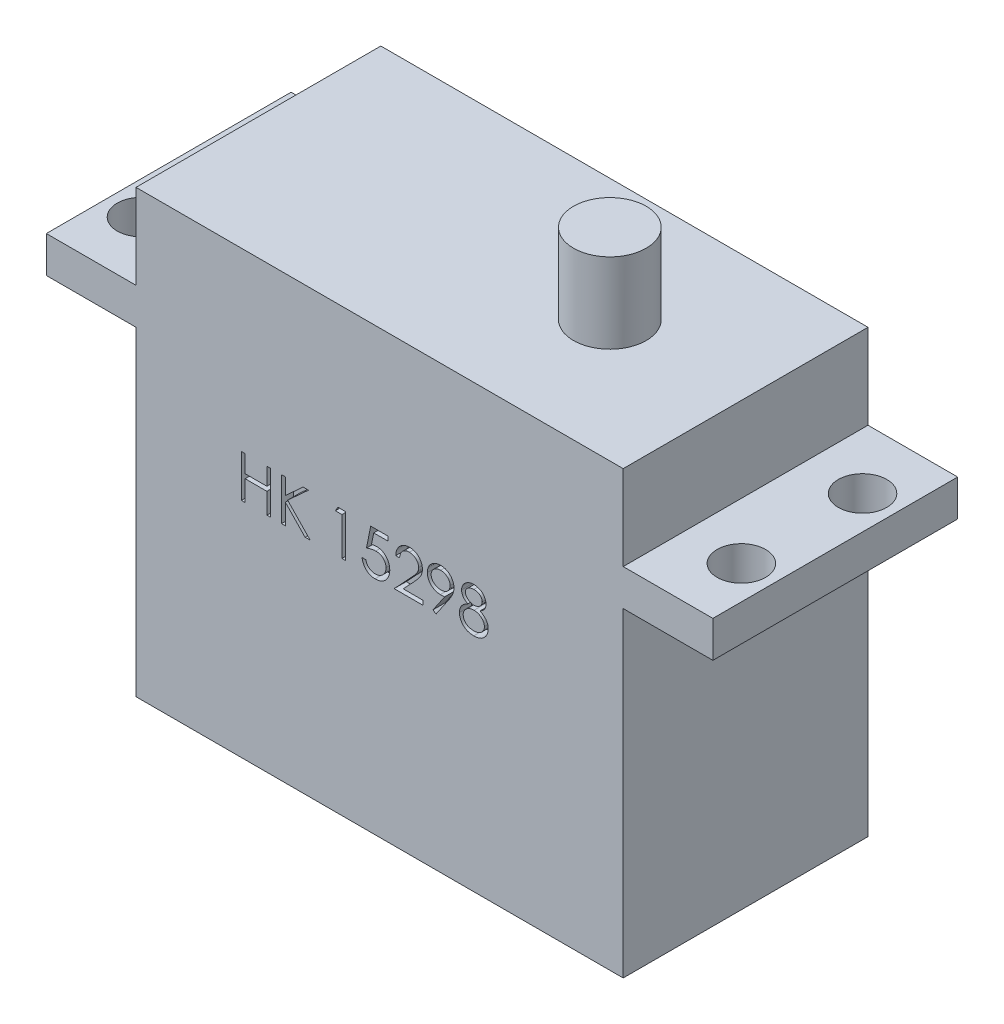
from build123d import *

# Parameters (mm, degrees)
BOSS_EXTRU_1_DEPTH      = 20.2
ESQUISSE2_R             = 2
ENL_V_MAT_EXTRU_1_DEPTH = 60.482434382
ESQUISSE3_R             = 3
BOSS_EXTRU_2_DEPTH      = 6.6
ENL_V_MAT_EXTRU_2_DEPTH = 1


with BuildPart() as part:
    # Esquisse1 → Boss.-Extru.1 (new body)
    with BuildSketch(Plane.XY):
        Polygon((0, 29.4), (0, 36.4), (40.2, 36.4), (40.2, 29.4), (47.6, 29.4), (47.6, 26.4), (40.2, 26.4), (40.2, 0), (0, 0), (0, 26.4), (-7.4, 26.4), (-7.4, 29.4), align=None)
    extrude(amount=BOSS_EXTRU_1_DEPTH)

    # Esquisse2 → Enl_v. mat.-Extru.1 (cut, through all)
    with BuildSketch(Plane(origin=(0, 29.4, 0), x_dir=(1, 0, 0), z_dir=(0, 1, 0))):
        with Locations(Location((-4.65, -5.1, 0), (0, 0, 270))):
            Circle(ESQUISSE2_R)
        with Locations(Location((-4.65, -15.1, 0), (0, 0, 270))):
            Circle(ESQUISSE2_R)
        with Locations(Location((44.85, -15.1, 0), (0, 0, 270))):
            Circle(ESQUISSE2_R)
        with Locations(Location((44.85, -5.1, 0), (0, 0, 270))):
            Circle(ESQUISSE2_R)
    extrude(amount=-ENL_V_MAT_EXTRU_1_DEPTH, mode=Mode.SUBTRACT)

    # Esquisse3 → Boss.-Extru.2 (add)
    with BuildSketch(Plane(origin=(0, 36.4, 0), x_dir=(1, 0, 0), z_dir=(0, 1, 0))):
        with Locations(Location((29, -10.1, 0), (0, 0, 90))):
            Circle(ESQUISSE3_R)
    extrude(amount=BOSS_EXTRU_2_DEPTH)

    # Esquisse4 → Enl_v. mat.-Extru.2 (cut)
    # profile 1 of 7: a face of its own
    with BuildSketch(Plane.XY.offset(20.2)):
        Polygon((8.690449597, 21.874406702), (9.004552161, 21.874406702), (9.004552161, 20.438509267), (10.799423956, 20.438509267), (10.799423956, 21.874406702), (11.11352652, 21.874406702), (11.11352652, 18.374406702), (10.799423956, 18.374406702), (10.799423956, 20.079534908), (9.004552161, 20.079534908), (9.004552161, 18.374406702), (8.690449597, 18.374406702), align=None)
    # profile 2 of 7: a face of its own
    with BuildSketch(Plane.XY.offset(20.2)):
        Polygon((12.010962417, 21.874406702), (12.325064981, 21.874406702), (12.325064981, 20.54157417), (13.784099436, 21.874406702), (14.232116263, 21.874406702), (12.5122645, 20.303893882), (14.366731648, 18.374406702), (13.948161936, 18.374406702), (12.325064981, 20.063409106), (12.325064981, 18.374406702), (12.010962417, 18.374406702), align=None)
    # profile 3 of 7: a face of its own
    with BuildSketch(Plane.XY.offset(20.2)):
        Polygon((16.658698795, 21.874406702), (17.305834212, 21.874406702), (17.305834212, 18.374406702), (16.991731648, 18.374406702), (16.991731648, 21.515432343), (16.453270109, 21.515432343), align=None)
    # profile 4 of 7: a face of its own
    with BuildSketch(Plane.XY.offset(20.2)):
        with BuildLine():
            Line((20.805834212, 21.874406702), (20.805834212, 21.515432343))
            Line((20.805834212, 21.515432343), (19.615329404, 21.515432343))
            Line((19.615329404, 21.515432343), (19.426727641, 20.594859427))
            add(Edge.make_bspline(
                [(19.426727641, 20.594859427), (19.463783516, 20.605089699), (19.535573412, 20.624909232), (19.641533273, 20.646915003), (19.742125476, 20.660180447), (19.807400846, 20.661991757), (19.838987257, 20.662868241)],
                knots=[0, 0, 0, 0, 1.100273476, 2.13160584, 3.095893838, 4, 4, 4, 4], degree=3))
            add(Edge.make_bspline(
                [(19.838987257, 20.662868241), (19.878070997, 20.662022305), (19.954919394, 20.660358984), (20.067358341, 20.644387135), (20.174691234, 20.61924722), (20.276693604, 20.584126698), (20.373554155, 20.539216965), (20.464381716, 20.483117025), (20.550539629, 20.417583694), (20.630482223, 20.342238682), (20.703006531, 20.259317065), (20.766772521, 20.170159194), (20.820935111, 20.075631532), (20.864495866, 19.974830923), (20.899280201, 19.86887177), (20.922432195, 19.756639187), (20.937848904, 19.639191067), (20.939571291, 19.558886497), (20.940449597, 19.51793635)],
                knots=[0, 0, 0, 0, 1.052922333, 2.070308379, 3.05430497, 4.020497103, 4.973039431, 5.925935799, 6.892292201, 7.88610001, 8.88166317, 9.857072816, 10.836096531, 11.812156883, 12.81219415, 13.836441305, 14.89672472, 16, 16, 16, 16], degree=3))
            add(Edge.make_bspline(
                [(20.940449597, 19.51793635), (20.939784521, 19.48941413), (20.938463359, 19.432755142), (20.931744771, 19.348610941), (20.918809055, 19.266248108), (20.901441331, 19.185655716), (20.878898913, 19.106986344), (20.851609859, 19.030014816), (20.818213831, 18.95522021), (20.781582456, 18.881894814), (20.740335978, 18.811696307), (20.694557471, 18.746047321), (20.64619198, 18.683963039), (20.594150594, 18.626109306), (20.537949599, 18.572866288), (20.478269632, 18.523918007), (20.415586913, 18.478436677), (20.348931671, 18.438268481), (20.279789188, 18.401305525), (20.207160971, 18.370981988), (20.13270027, 18.34387146), (20.055335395, 18.322261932), (19.975241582, 18.305329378), (19.892286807, 18.293828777), (19.806906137, 18.28545234), (19.749031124, 18.284927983), (19.719796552, 18.284663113)],
                knots=[0, 0, 0, 0, 1.056347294, 2.098418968, 3.122841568, 4.141288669, 5.149314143, 6.15115421, 7.162517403, 8.180376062, 9.185164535, 10.17417709, 11.141909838, 12.097768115, 13.052685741, 14.0056014, 14.954263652, 15.917497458, 16.885230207, 17.854509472, 18.828990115, 19.81800267, 20.826176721, 21.857883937, 22.917946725, 24, 24, 24, 24], degree=3))
            add(Edge.make_bspline(
                [(19.719796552, 18.284663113), (19.684922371, 18.285353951), (19.61631154, 18.286713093), (19.515790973, 18.300931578), (19.419076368, 18.321295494), (19.326946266, 18.351931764), (19.238575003, 18.390319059), (19.155152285, 18.438835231), (19.074546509, 18.493814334), (19.000034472, 18.558694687), (18.930878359, 18.629610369), (18.86897185, 18.70656801), (18.813838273, 18.788297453), (18.766360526, 18.875195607), (18.725862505, 18.967034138), (18.694047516, 19.064157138), (18.668369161, 19.166057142), (18.657505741, 19.236210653), (18.651988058, 19.2718426)],
                knots=[0, 0, 0, 0, 1.0467383, 2.05933395, 3.04377827, 4.011590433, 4.970194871, 5.932262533, 6.905835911, 7.896367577, 8.894135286, 9.877477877, 10.858688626, 11.851381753, 12.8477658, 13.868841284, 14.917554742, 16, 16, 16, 16], degree=3))
            Line((18.651988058, 19.2718426), (18.966090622, 19.2718426))
            add(Edge.make_bspline(
                [(18.966090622, 19.2718426), (18.97381918, 19.238466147), (18.988673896, 19.174314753), (19.021279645, 19.084183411), (19.06114552, 19.003864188), (19.108549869, 18.932294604), (19.165099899, 18.869885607), (19.229629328, 18.814268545), (19.301977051, 18.764093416), (19.382370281, 18.722270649), (19.46718336, 18.686601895), (19.55595057, 18.6628502), (19.646254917, 18.646149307), (19.707333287, 18.644477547), (19.738025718, 18.643637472)],
                knots=[0, 0, 0, 0, 1.136247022, 2.183929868, 3.172523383, 4.106158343, 5.02341133, 5.958108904, 6.928429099, 7.938127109, 8.96079061, 9.975095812, 10.982467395, 12, 12, 12, 12], degree=3))
            add(Edge.make_bspline(
                [(19.738025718, 18.643637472), (19.767984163, 18.64445825), (19.826972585, 18.646074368), (19.913783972, 18.65851338), (19.997596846, 18.677670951), (20.077584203, 18.706340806), (20.155145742, 18.741185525), (20.228319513, 18.785900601), (20.29922239, 18.837360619), (20.365650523, 18.896317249), (20.426489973, 18.961286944), (20.480246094, 19.030764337), (20.525023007, 19.104881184), (20.562757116, 19.182354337), (20.591410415, 19.264032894), (20.611851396, 19.349534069), (20.623854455, 19.439069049), (20.625505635, 19.500138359), (20.626347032, 19.531257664)],
                knots=[0, 0, 0, 0, 1.027316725, 2.022795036, 3.002884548, 3.971462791, 4.93288096, 5.914575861, 6.907176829, 7.935150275, 8.956128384, 9.956726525, 10.942570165, 11.921478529, 12.907843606, 13.90538589, 14.932640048, 16, 16, 16, 16], degree=3))
            add(Edge.make_bspline(
                [(20.626347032, 19.531257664), (20.625688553, 19.559333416), (20.624399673, 19.614287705), (20.613869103, 19.694686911), (20.59555213, 19.770759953), (20.570128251, 19.842874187), (20.537848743, 19.91109763), (20.49840243, 19.97550069), (20.451049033, 20.035234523), (20.396957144, 20.090327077), (20.337699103, 20.141171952), (20.27225536, 20.184516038), (20.201995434, 20.220979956), (20.127765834, 20.252447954), (20.047800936, 20.275048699), (19.963684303, 20.292016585), (19.874507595, 20.301831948), (19.813536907, 20.303193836), (19.782196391, 20.303893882)],
                knots=[0, 0, 0, 0, 1.045622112, 2.046656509, 3.013763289, 3.955457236, 4.890082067, 5.820317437, 6.762574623, 7.722996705, 8.69280354, 9.665887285, 10.63943826, 11.638615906, 12.663482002, 13.728887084, 14.832589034, 16, 16, 16, 16], degree=3))
            add(Edge.make_bspline(
                [(19.782196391, 20.303893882), (19.755067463, 20.303313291), (19.699053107, 20.302114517), (19.613130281, 20.293288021), (19.522838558, 20.279048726), (19.428524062, 20.259462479), (19.329903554, 20.233831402), (19.227185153, 20.203116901), (19.120152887, 20.166394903), (19.048035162, 20.138662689), (19.010962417, 20.124406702)],
                knots=[0, 0, 0, 0, 0.817624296, 1.688186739, 2.600797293, 3.572016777, 4.590301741, 5.671205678, 6.80286297, 8, 8, 8, 8], degree=3))
            Line((19.010962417, 20.124406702), (19.369936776, 21.874406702))
            Line((19.369936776, 21.874406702), (20.805834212, 21.874406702))
        make_face()
    # profile 5 of 7: a face of its own
    with BuildSketch(Plane.XY.offset(20.2)):
        with BuildLine():
            Line((21.748141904, 20.797483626), (21.43403934, 20.797483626))
            add(Edge.make_bspline(
                [(21.43403934, 20.797483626), (21.436086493, 20.839154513), (21.440107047, 20.920995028), (21.458935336, 21.040318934), (21.485876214, 21.154373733), (21.523967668, 21.262243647), (21.571273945, 21.364882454), (21.628003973, 21.46188247), (21.695197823, 21.552873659), (21.771404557, 21.637012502), (21.854173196, 21.714200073), (21.943479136, 21.780855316), (22.037324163, 21.837172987), (22.135423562, 21.884254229), (22.238884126, 21.919594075), (22.346766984, 21.945815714), (22.45954612, 21.96159206), (22.536386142, 21.963287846), (22.575465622, 21.964150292)],
                knots=[0, 0, 0, 0, 1.10065271, 2.161652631, 3.183658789, 4.190468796, 5.17591951, 6.163126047, 7.15150782, 8.156236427, 9.156009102, 10.134482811, 11.092018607, 12.041330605, 13.001268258, 13.972401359, 14.968799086, 16, 16, 16, 16], degree=3))
            add(Edge.make_bspline(
                [(22.575465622, 21.964150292), (22.613843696, 21.963251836), (22.689255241, 21.961486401), (22.799317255, 21.946325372), (22.90409455, 21.92257978), (23.003382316, 21.889264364), (23.096388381, 21.844479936), (23.183811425, 21.790682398), (23.266692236, 21.728462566), (23.34129902, 21.655208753), (23.409807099, 21.577006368), (23.468909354, 21.493518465), (23.519522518, 21.407289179), (23.561710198, 21.317660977), (23.592766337, 21.223789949), (23.616344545, 21.127042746), (23.629671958, 21.026417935), (23.631717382, 20.95831138), (23.632757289, 20.923685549)],
                knots=[0, 0, 0, 0, 1.111607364, 2.184268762, 3.212621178, 4.221274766, 5.211760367, 6.196651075, 7.1921475, 8.207485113, 9.220403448, 10.201281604, 11.166441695, 12.114753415, 13.065576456, 14.026450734, 14.996634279, 16, 16, 16, 16], degree=3))
            add(Edge.make_bspline(
                [(23.632757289, 20.923685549), (23.631064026, 20.874937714), (23.627707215, 20.7782975), (23.598992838, 20.636282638), (23.554146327, 20.498689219), (23.50014897, 20.387951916), (23.445676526, 20.298718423), (23.396589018, 20.225249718), (23.339124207, 20.146144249), (23.272445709, 20.061666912), (23.197932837, 19.971156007), (23.114910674, 19.874666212), (23.022787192, 19.773194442), (22.958128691, 19.70388884), (22.924624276, 19.667976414)],
                knots=[0, 0, 0, 0, 1.184426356, 2.348067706, 3.509069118, 4.696110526, 5.333549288, 6.050745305, 6.844228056, 7.710549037, 8.667450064, 9.695053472, 10.805634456, 12, 12, 12, 12], degree=3))
            Line((22.924624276, 19.667976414), (22.048923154, 18.733381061))
            Line((22.048923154, 18.733381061), (23.677629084, 18.733381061))
            Line((23.677629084, 18.733381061), (23.677629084, 18.374406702))
            Line((23.677629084, 18.374406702), (21.299423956, 18.374406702))
            Line((21.299423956, 18.374406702), (22.65679575, 19.822924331))
            add(Edge.make_bspline(
                [(22.65679575, 19.822924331), (22.689843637, 19.857422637), (22.753321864, 19.923686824), (22.843104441, 20.020429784), (22.923743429, 20.110179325), (22.995760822, 20.192765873), (23.057594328, 20.269397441), (23.11246656, 20.337592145), (23.156432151, 20.400346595), (23.204147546, 20.473087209), (23.250361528, 20.561899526), (23.290073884, 20.670433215), (23.314288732, 20.782160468), (23.317193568, 20.857662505), (23.318654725, 20.895640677)],
                knots=[0, 0, 0, 0, 1.329631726, 2.553950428, 3.673215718, 4.687767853, 5.603093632, 6.413772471, 7.123043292, 7.734684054, 8.834405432, 9.900288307, 10.943827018, 12, 12, 12, 12], degree=3))
            add(Edge.make_bspline(
                [(23.318654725, 20.895640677), (23.318018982, 20.919522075), (23.316766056, 20.966587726), (23.305708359, 21.035593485), (23.288997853, 21.102158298), (23.265052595, 21.166486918), (23.233445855, 21.22793257), (23.194972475, 21.28657005), (23.150582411, 21.343259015), (23.099231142, 21.396412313), (23.042819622, 21.445093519), (22.983225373, 21.488217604), (22.920175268, 21.524256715), (22.853935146, 21.553800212), (22.784689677, 21.576975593), (22.712304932, 21.593034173), (22.636980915, 21.603116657), (22.58554742, 21.604480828), (22.559339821, 21.605175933)],
                knots=[0, 0, 0, 0, 0.991446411, 1.95395049, 2.89581595, 3.838931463, 4.798493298, 5.75982156, 6.748411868, 7.785213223, 8.824556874, 9.840280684, 10.836137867, 11.835679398, 12.848801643, 13.863922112, 14.911575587, 16, 16, 16, 16], degree=3))
            add(Edge.make_bspline(
                [(22.559339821, 21.605175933), (22.531968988, 21.604460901), (22.478217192, 21.603056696), (22.399298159, 21.593234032), (22.324012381, 21.576288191), (22.252170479, 21.553111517), (22.183650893, 21.523652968), (22.118786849, 21.486961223), (22.057723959, 21.44317773), (22.000347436, 21.393537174), (21.947483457, 21.338269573), (21.901036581, 21.27665961), (21.860452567, 21.209832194), (21.825043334, 21.137967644), (21.796287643, 21.060413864), (21.774314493, 20.977446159), (21.756927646, 20.889424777), (21.751119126, 20.828639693), (21.748141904, 20.797483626)],
                knots=[0, 0, 0, 0, 1.031018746, 2.02475058, 2.990194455, 3.934040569, 4.864654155, 5.795059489, 6.735614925, 7.690564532, 8.649604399, 9.611025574, 10.590972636, 11.591080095, 12.624614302, 13.701020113, 14.821632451, 16, 16, 16, 16], degree=3))
        make_face()
    # profile 6 of 7: a face of its own
    with BuildSketch(Plane.XY.offset(20.2)):
        with BuildLine():
            Line((24.754552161, 18.284663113), (24.503550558, 18.45924244))
            Line((24.503550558, 18.45924244), (25.476707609, 19.881818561))
            add(Edge.make_bspline(
                [(25.476707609, 19.881818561), (25.414616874, 19.874225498), (25.292356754, 19.859274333), (25.169219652, 19.856527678), (25.108618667, 19.855175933)],
                knots=[0, 0, 0, 0, 1.015715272, 2, 2, 2, 2], degree=3))
            add(Edge.make_bspline(
                [(25.108618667, 19.855175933), (25.071876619, 19.85611701), (24.999755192, 19.85796426), (24.89372354, 19.872606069), (24.791837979, 19.895156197), (24.694368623, 19.928804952), (24.600949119, 19.970623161), (24.511783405, 20.022480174), (24.426991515, 20.083486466), (24.347484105, 20.153319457), (24.275172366, 20.22999751), (24.210749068, 20.311153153), (24.157207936, 20.397729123), (24.112731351, 20.487959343), (24.079000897, 20.583140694), (24.05443836, 20.682190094), (24.039316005, 20.785801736), (24.03751691, 20.856326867), (24.036603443, 20.892135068)],
                knots=[0, 0, 0, 0, 1.060718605, 2.082097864, 3.085795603, 4.069760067, 5.054557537, 6.03741023, 7.043284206, 8.066802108, 9.088538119, 10.083643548, 11.053783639, 12.022749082, 12.983451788, 13.964007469, 14.966251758, 16, 16, 16, 16], degree=3))
            add(Edge.make_bspline(
                [(24.036603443, 20.892135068), (24.038337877, 20.941103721), (24.041742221, 21.037219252), (24.069140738, 21.177653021), (24.114201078, 21.310439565), (24.177029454, 21.435229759), (24.256164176, 21.550228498), (24.351272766, 21.653837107), (24.46177673, 21.744581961), (24.585158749, 21.822586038), (24.71851177, 21.885321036), (24.858180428, 21.931560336), (25.003094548, 21.958759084), (25.101262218, 21.962344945), (25.150685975, 21.964150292)],
                knots=[0, 0, 0, 0, 1.022988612, 2.007919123, 2.978103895, 3.94594894, 4.918897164, 5.887013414, 6.875921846, 7.89917871, 8.930658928, 9.948724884, 10.967259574, 12, 12, 12, 12], degree=3))
            add(Edge.make_bspline(
                [(25.150685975, 21.964150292), (25.199174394, 21.962320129), (25.294982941, 21.958703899), (25.435871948, 21.93221993), (25.570812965, 21.887583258), (25.699057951, 21.825898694), (25.817797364, 21.748577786), (25.924573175, 21.656443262), (26.016948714, 21.549437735), (26.094772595, 21.430149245), (26.157242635, 21.301982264), (26.202314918, 21.168198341), (26.230060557, 21.02975962), (26.233556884, 20.935965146), (26.235321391, 20.888629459)],
                knots=[0, 0, 0, 0, 1.026385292, 2.028040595, 3.023318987, 4.028184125, 5.03290303, 6.015178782, 7.004435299, 8.016004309, 9.023023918, 10.015172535, 10.998308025, 12, 12, 12, 12], degree=3))
            add(Edge.make_bspline(
                [(26.235321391, 20.888629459), (26.234142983, 20.851885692), (26.231752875, 20.777360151), (26.215016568, 20.664129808), (26.186596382, 20.548678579), (26.154344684, 20.450956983), (26.123212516, 20.370248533), (26.093911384, 20.306496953), (26.061399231, 20.23939569), (26.023480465, 20.169648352), (25.982718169, 20.096365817), (25.936658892, 20.020283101), (25.88635332, 19.941298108), (25.850523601, 19.88805102), (25.832176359, 19.860784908)],
                knots=[0, 0, 0, 0, 1.179839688, 2.393009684, 3.667231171, 4.993948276, 5.694988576, 6.444077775, 7.246288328, 8.089075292, 8.993003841, 9.939041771, 10.944649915, 12, 12, 12, 12], degree=3))
            Line((25.832176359, 19.860784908), (24.754552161, 18.284663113))
        make_face()
        with BuildLine():
            add(Edge.make_bspline(
                [(25.166811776, 20.214150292), (25.19464579, 20.214910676), (25.248829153, 20.216390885), (25.328206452, 20.225400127), (25.403130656, 20.241374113), (25.473801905, 20.264293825), (25.540928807, 20.291950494), (25.603445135, 20.32716248), (25.66140321, 20.369179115), (25.715191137, 20.41638913), (25.762955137, 20.468839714), (25.805498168, 20.523736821), (25.841658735, 20.58132143), (25.870222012, 20.642314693), (25.893706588, 20.705231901), (25.9099246, 20.771086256), (25.918908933, 20.839534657), (25.920440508, 20.886033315), (25.921218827, 20.909663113)],
                knots=[0, 0, 0, 0, 1.163407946, 2.26475976, 3.333800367, 4.359385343, 5.366239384, 6.363380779, 7.350133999, 8.353570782, 9.349036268, 10.310270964, 11.253520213, 12.184142, 13.120487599, 14.056272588, 15.012232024, 16, 16, 16, 16], degree=3))
            add(Edge.make_bspline(
                [(25.921218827, 20.909663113), (25.920549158, 20.933302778), (25.919229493, 20.979887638), (25.908642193, 21.048437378), (25.89001697, 21.114130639), (25.865026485, 21.177327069), (25.832106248, 21.23750744), (25.792602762, 21.295427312), (25.745670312, 21.35071944), (25.691667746, 21.402083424), (25.633433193, 21.449431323), (25.571372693, 21.491217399), (25.505997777, 21.526238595), (25.437707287, 21.555137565), (25.366358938, 21.577689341), (25.29199495, 21.593906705), (25.214239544, 21.60287846), (25.161458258, 21.604400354), (25.134560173, 21.605175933)],
                knots=[0, 0, 0, 0, 0.972161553, 1.915763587, 2.844109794, 3.775983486, 4.705125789, 5.659731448, 6.655561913, 7.682237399, 8.721216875, 9.739758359, 10.754845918, 11.767244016, 12.7857855, 13.828538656, 14.893392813, 16, 16, 16, 16], degree=3))
            add(Edge.make_bspline(
                [(25.134560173, 21.605175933), (25.10789602, 21.604399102), (25.055581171, 21.602874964), (24.978517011, 21.593923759), (24.904655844, 21.577580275), (24.833514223, 21.555148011), (24.765225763, 21.526236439), (24.69985393, 21.491215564), (24.637778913, 21.449440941), (24.579600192, 21.402046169), (24.52550227, 21.350958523), (24.479376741, 21.295185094), (24.439782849, 21.23753757), (24.406907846, 21.177319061), (24.381905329, 21.114132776), (24.363283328, 21.048436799), (24.352695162, 20.979887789), (24.351375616, 20.933302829), (24.350706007, 20.909663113)],
                knots=[0, 0, 0, 0, 1.099389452, 2.15699305, 3.192601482, 4.213358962, 5.227959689, 6.245255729, 7.266013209, 8.307253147, 9.336162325, 10.327954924, 11.284637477, 12.215801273, 13.149702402, 14.080068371, 15.025723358, 16, 16, 16, 16], degree=3))
            add(Edge.make_bspline(
                [(24.350706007, 20.909663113), (24.351311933, 20.886014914), (24.35250693, 20.839376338), (24.36403472, 20.770849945), (24.383313, 20.705161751), (24.40913239, 20.641673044), (24.44313398, 20.581001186), (24.484857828, 20.523433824), (24.533763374, 20.468318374), (24.589196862, 20.416511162), (24.649865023, 20.368958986), (24.714661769, 20.327428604), (24.782471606, 20.29235616), (24.853533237, 20.264214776), (24.927320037, 20.241603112), (25.004495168, 20.225429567), (25.084803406, 20.2164773), (25.139213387, 20.214933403), (25.166811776, 20.214150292)],
                knots=[0, 0, 0, 0, 0.952633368, 1.87876736, 2.791047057, 3.707742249, 4.635551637, 5.587206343, 6.568248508, 7.601284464, 8.641511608, 9.671105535, 10.699146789, 11.713763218, 12.747829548, 13.806491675, 14.887386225, 16, 16, 16, 16], degree=3))
        make_face(mode=Mode.SUBTRACT)
    # profile 7 of 7: a face of its own
    with BuildSketch(Plane.XY.offset(20.2)):
        with BuildLine():
            add(Edge.make_bspline(
                [(28.385661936, 20.324226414), (28.414310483, 20.309288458), (28.470184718, 20.280154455), (28.549761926, 20.233243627), (28.622486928, 20.183802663), (28.690377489, 20.134166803), (28.75224084, 20.082435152), (28.807385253, 20.028401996), (28.857172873, 19.97341605), (28.900599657, 19.91654621), (28.938796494, 19.857943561), (28.971808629, 19.797454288), (29.000025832, 19.735210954), (29.02238877, 19.670534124), (29.040810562, 19.604373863), (29.053486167, 19.535875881), (29.060303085, 19.46549154), (29.061591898, 19.417923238), (29.062244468, 19.393837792)],
                knots=[0, 0, 0, 0, 1.272397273, 2.481599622, 3.635517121, 4.734568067, 5.792894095, 6.808321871, 7.773003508, 8.711915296, 9.623354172, 10.525449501, 11.423591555, 12.311487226, 13.218079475, 14.126165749, 15.051214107, 16, 16, 16, 16], degree=3))
            add(Edge.make_bspline(
                [(29.062244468, 19.393837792), (29.061473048, 19.36014006), (29.059946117, 19.293439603), (29.046646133, 19.194993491), (29.026733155, 19.099381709), (28.997653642, 19.006625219), (28.959940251, 18.917235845), (28.913463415, 18.831137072), (28.86085221, 18.746917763), (28.818599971, 18.695098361), (28.79722043, 18.668877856)],
                knots=[0, 0, 0, 0, 1.025265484, 2.029385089, 3.018602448, 3.995076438, 4.983346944, 5.966715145, 6.97116228, 8, 8, 8, 8], degree=3))
            add(Edge.make_bspline(
                [(28.79722043, 18.668877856), (28.769383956, 18.638284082), (28.71405499, 18.577474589), (28.619272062, 18.498523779), (28.515250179, 18.432174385), (28.402391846, 18.378102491), (28.280998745, 18.336016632), (28.15109674, 18.305774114), (28.012432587, 18.288451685), (27.917127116, 18.285947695), (27.868234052, 18.284663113)],
                knots=[0, 0, 0, 0, 0.954267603, 1.896743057, 2.838368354, 3.796610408, 4.779680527, 5.799409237, 6.871065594, 8, 8, 8, 8], degree=3))
            add(Edge.make_bspline(
                [(27.868234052, 18.284663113), (27.821220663, 18.285815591), (27.729737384, 18.288058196), (27.596579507, 18.303252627), (27.472456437, 18.329880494), (27.356646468, 18.366325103), (27.249847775, 18.413735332), (27.152364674, 18.47274374), (27.062790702, 18.540975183), (26.983844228, 18.620389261), (26.913755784, 18.705447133), (26.852187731, 18.793198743), (26.801013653, 18.8836521), (26.757686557, 18.975458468), (26.724518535, 19.069904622), (26.701546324, 19.166504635), (26.68695701, 19.265089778), (26.685015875, 19.331621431), (26.68403934, 19.365091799)],
                knots=[0, 0, 0, 0, 1.256902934, 2.445805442, 3.576955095, 4.645999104, 5.686449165, 6.692658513, 7.68621702, 8.689161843, 9.678783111, 10.630372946, 11.551080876, 12.453998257, 13.34127905, 14.221779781, 15.105423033, 16, 16, 16, 16], degree=3))
            add(Edge.make_bspline(
                [(26.68403934, 19.365091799), (26.684617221, 19.389650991), (26.685759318, 19.438188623), (26.693664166, 19.509897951), (26.706372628, 19.579694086), (26.723632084, 19.647834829), (26.747023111, 19.713824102), (26.775265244, 19.777974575), (26.808197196, 19.840358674), (26.846278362, 19.901317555), (26.890580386, 19.959997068), (26.940744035, 20.017393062), (26.997771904, 20.072614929), (27.061029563, 20.126337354), (27.129794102, 20.179513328), (27.205851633, 20.229269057), (27.287185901, 20.279127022), (27.344991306, 20.308935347), (27.374644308, 20.324226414)],
                knots=[0, 0, 0, 0, 0.941657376, 1.861047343, 2.762797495, 3.66048619, 4.553285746, 5.444104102, 6.34607688, 7.256116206, 8.197091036, 9.162375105, 10.176350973, 11.237807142, 12.343728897, 13.50695164, 14.721116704, 16, 16, 16, 16], degree=3))
            add(Edge.make_bspline(
                [(27.374644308, 20.324226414), (27.334052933, 20.346361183), (27.255456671, 20.38922029), (27.151387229, 20.467967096), (27.061996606, 20.553254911), (26.989741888, 20.646884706), (26.93286966, 20.74593158), (26.893851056, 20.849775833), (26.867454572, 20.956491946), (26.864839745, 21.029398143), (26.86352652, 21.066013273)],
                knots=[0, 0, 0, 0, 1.166880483, 2.259407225, 3.286803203, 4.280235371, 5.237608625, 6.161067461, 7.076446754, 8, 8, 8, 8], degree=3))
            add(Edge.make_bspline(
                [(26.86352652, 21.066013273), (26.865161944, 21.103310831), (26.868449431, 21.178285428), (26.895032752, 21.289891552), (26.938352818, 21.399508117), (26.997273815, 21.506603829), (27.070661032, 21.607554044), (27.158707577, 21.69809499), (27.259310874, 21.777406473), (27.371968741, 21.843982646), (27.493204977, 21.898166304), (27.621120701, 21.935544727), (27.753487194, 21.959980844), (27.843584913, 21.962747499), (27.889267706, 21.964150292)],
                knots=[0, 0, 0, 0, 0.888701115, 1.786444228, 2.72001202, 3.692817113, 4.693886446, 5.687152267, 6.695133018, 7.739871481, 8.800368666, 9.853104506, 10.91144658, 12, 12, 12, 12], degree=3))
            add(Edge.make_bspline(
                [(27.889267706, 21.964150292), (27.933771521, 21.962703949), (28.021527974, 21.959851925), (28.150522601, 21.936065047), (28.273947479, 21.896335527), (28.391376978, 21.842438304), (28.500708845, 21.776051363), (28.597311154, 21.695650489), (28.682643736, 21.605508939), (28.753228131, 21.504589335), (28.81139102, 21.397905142), (28.851891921, 21.286282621), (28.877843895, 21.172133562), (28.881117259, 21.094895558), (28.882757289, 21.056197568)],
                knots=[0, 0, 0, 0, 1.072916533, 2.115669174, 3.151510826, 4.193348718, 5.225979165, 6.227137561, 7.216255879, 8.211077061, 9.189680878, 10.138522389, 11.067357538, 12, 12, 12, 12], degree=3))
            add(Edge.make_bspline(
                [(28.882757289, 21.056197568), (28.881322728, 21.018220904), (28.878505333, 20.943636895), (28.854805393, 20.834910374), (28.81489208, 20.733088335), (28.760397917, 20.637015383), (28.689372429, 20.548433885), (28.602763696, 20.466217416), (28.501262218, 20.389690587), (28.425001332, 20.346504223), (28.385661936, 20.324226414)],
                knots=[0, 0, 0, 0, 0.975232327, 1.915300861, 2.843280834, 3.77672583, 4.742871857, 5.749627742, 6.839139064, 8, 8, 8, 8], degree=3))
        make_face()
        with BuildLine():
            add(Edge.make_bspline(
                [(27.871739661, 21.605175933), (27.847188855, 21.604524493), (27.799156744, 21.60324999), (27.728728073, 21.596591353), (27.661755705, 21.583638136), (27.597539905, 21.566399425), (27.536961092, 21.543111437), (27.479196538, 21.515716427), (27.425229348, 21.482410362), (27.374408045, 21.445049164), (27.32865727, 21.403956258), (27.288052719, 21.361142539), (27.254324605, 21.315767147), (27.225683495, 21.268958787), (27.204901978, 21.219328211), (27.189337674, 21.168397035), (27.178816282, 21.115521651), (27.178027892, 21.07938514), (27.177629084, 21.06110542)],
                knots=[0, 0, 0, 0, 1.203892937, 2.355340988, 3.463153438, 4.544400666, 5.610487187, 6.640501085, 7.674077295, 8.714426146, 9.728707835, 10.68524104, 11.601827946, 12.495867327, 13.368432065, 14.231010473, 15.105153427, 16, 16, 16, 16], degree=3))
            add(Edge.make_bspline(
                [(27.177629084, 21.06110542), (27.178316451, 21.042824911), (27.179674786, 21.006699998), (27.190179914, 20.953354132), (27.205836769, 20.900932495), (27.230487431, 20.850681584), (27.260053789, 20.800858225), (27.296545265, 20.752707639), (27.340034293, 20.706062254), (27.389061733, 20.661318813), (27.442473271, 20.61942005), (27.499057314, 20.583046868), (27.558103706, 20.552612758), (27.619005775, 20.527283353), (27.682384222, 20.507593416), (27.747850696, 20.493624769), (27.815416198, 20.484942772), (27.861196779, 20.483905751), (27.884359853, 20.483381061)],
                knots=[0, 0, 0, 0, 0.873023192, 1.725219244, 2.590779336, 3.480155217, 4.391973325, 5.357036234, 6.360879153, 7.436073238, 8.526419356, 9.601555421, 10.645666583, 11.697338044, 12.750135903, 13.812665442, 14.89329948, 16, 16, 16, 16], degree=3))
            add(Edge.make_bspline(
                [(27.884359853, 20.483381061), (27.914109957, 20.484253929), (27.973316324, 20.485991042), (28.060595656, 20.502142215), (28.1454583, 20.527548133), (28.226997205, 20.562308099), (28.30310179, 20.605935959), (28.370941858, 20.658168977), (28.429938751, 20.717801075), (28.479479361, 20.78390391), (28.517889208, 20.854255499), (28.547791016, 20.924855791), (28.565252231, 20.996458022), (28.567529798, 21.044424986), (28.568654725, 21.068116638)],
                knots=[0, 0, 0, 0, 1.076279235, 2.141928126, 3.20205304, 4.278698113, 5.344010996, 6.36967002, 7.368914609, 8.37248503, 9.349703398, 10.264243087, 11.142681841, 12, 12, 12, 12], degree=3))
            add(Edge.make_bspline(
                [(28.568654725, 21.068116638), (28.568122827, 21.084744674), (28.567067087, 21.117748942), (28.558367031, 21.166487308), (28.543991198, 21.214116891), (28.524528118, 21.261031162), (28.498918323, 21.306571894), (28.468554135, 21.351454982), (28.431669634, 21.394670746), (28.390273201, 21.437226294), (28.343327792, 21.476610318), (28.29092388, 21.511245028), (28.233330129, 21.540657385), (28.170545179, 21.564546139), (28.102800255, 21.582488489), (28.030407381, 21.595924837), (27.952762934, 21.603497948), (27.899333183, 21.604604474), (27.871739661, 21.605175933)],
                knots=[0, 0, 0, 0, 0.814439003, 1.616544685, 2.417341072, 3.248991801, 4.09997495, 4.973547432, 5.9003056, 6.880240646, 7.880314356, 8.896779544, 9.951930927, 11.043077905, 12.18215768, 13.381699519, 14.647792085, 16, 16, 16, 16], degree=3))
        make_face(mode=Mode.SUBTRACT)
        with BuildLine():
            add(Edge.make_bspline(
                [(27.892072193, 20.124406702), (27.860946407, 20.123853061), (27.799885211, 20.122766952), (27.710428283, 20.110677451), (27.624575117, 20.093848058), (27.542615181, 20.06831722), (27.464583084, 20.03512073), (27.390056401, 19.99518619), (27.319605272, 19.947980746), (27.254202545, 19.894104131), (27.194479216, 19.836044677), (27.142080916, 19.774582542), (27.097583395, 19.710860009), (27.061750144, 19.64406778), (27.032338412, 19.575620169), (27.013024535, 19.503812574), (27.000642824, 19.43002546), (26.998980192, 19.379865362), (26.998141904, 19.354574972)],
                knots=[0, 0, 0, 0, 1.140299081, 2.23698856, 3.303958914, 4.344563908, 5.37730929, 6.408454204, 7.439741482, 8.480804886, 9.510774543, 10.48932336, 11.43758569, 12.353841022, 13.263987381, 14.161954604, 15.073269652, 16, 16, 16, 16], degree=3))
            add(Edge.make_bspline(
                [(26.998141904, 19.354574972), (26.999505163, 19.323144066), (27.002209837, 19.260785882), (27.023666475, 19.168622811), (27.058102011, 19.079401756), (27.106127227, 18.993849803), (27.165594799, 18.913899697), (27.238721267, 18.844210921), (27.320962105, 18.782289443), (27.415099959, 18.732208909), (27.517928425, 18.692214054), (27.629420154, 18.664658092), (27.747975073, 18.646416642), (27.829834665, 18.644578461), (27.871739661, 18.643637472)],
                knots=[0, 0, 0, 0, 0.898778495, 1.783155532, 2.693654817, 3.627872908, 4.583023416, 5.533784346, 6.509005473, 7.520592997, 8.575161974, 9.658835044, 10.801527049, 12, 12, 12, 12], degree=3))
            add(Edge.make_bspline(
                [(27.871739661, 18.643637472), (27.904490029, 18.64426628), (27.968298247, 18.645491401), (28.061384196, 18.656305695), (28.149228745, 18.67345532), (28.231661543, 18.698398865), (28.309605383, 18.728848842), (28.381738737, 18.768020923), (28.449917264, 18.812573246), (28.510781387, 18.865431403), (28.566214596, 18.921910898), (28.614547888, 18.981700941), (28.65650544, 19.043176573), (28.689436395, 19.107727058), (28.715762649, 19.174113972), (28.734686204, 19.242949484), (28.746362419, 19.314444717), (28.747543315, 19.362943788), (28.748141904, 19.387527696)],
                knots=[0, 0, 0, 0, 1.224942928, 2.386581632, 3.501229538, 4.569074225, 5.605009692, 6.626002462, 7.634866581, 8.645888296, 9.63523824, 10.59253846, 11.518950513, 12.414518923, 13.29783783, 14.186679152, 15.080837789, 16, 16, 16, 16], degree=3))
            add(Edge.make_bspline(
                [(28.748141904, 19.387527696), (28.747236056, 19.411405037), (28.745449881, 19.458486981), (28.734113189, 19.528253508), (28.714197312, 19.595656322), (28.686869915, 19.661506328), (28.650488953, 19.724469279), (28.607644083, 19.78618545), (28.555949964, 19.844941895), (28.497537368, 19.901194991), (28.433878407, 19.953210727), (28.366211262, 19.999225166), (28.2950568, 20.037977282), (28.220565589, 20.069493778), (28.142903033, 20.094281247), (28.062126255, 20.111597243), (27.97814068, 20.122496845), (27.921085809, 20.123762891), (27.892072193, 20.124406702)],
                knots=[0, 0, 0, 0, 0.917430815, 1.809013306, 2.70690318, 3.612392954, 4.541220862, 5.495268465, 6.494511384, 7.542276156, 8.608045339, 9.649016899, 10.681629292, 11.715607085, 12.752076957, 13.808767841, 14.885711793, 16, 16, 16, 16], degree=3))
        make_face(mode=Mode.SUBTRACT)
    extrude(amount=-ENL_V_MAT_EXTRU_2_DEPTH, mode=Mode.SUBTRACT)


solid = part.part
